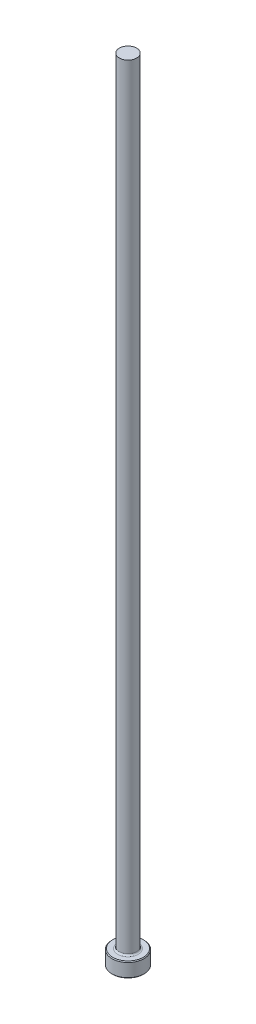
from build123d import *

# Parameters (mm, degrees)
CHAMFER1_SIZE = 0.254
FILLET1_R     = 0.508


with BuildPart() as part:
    # Sketch1 → Revolve1 (revolve)
    with BuildSketch(Plane.XY, mode=Mode.PRIVATE) as revolve1_sk:
        Polygon((0, 0), (-5.1562, 0), (-5.1562, 4.7498), (-2.77749, 4.7498), (-2.77749, 254), (0, 254), align=None)
    revolve(revolve1_sk.sketch.rotate(Axis((0, 259.958771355, 0), (0, -1, 0)), 270), axis=Axis((0, 259.958771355, 0), (0, -1, 0)))

    # Chamfer1
    chamfer1_edges = [part.edges().sort_by_distance(p)[0] for p in [
        (0, 4.7498, -5.1562),
        (0, 0, -5.1562),
    ]]
    chamfer(chamfer1_edges, length=CHAMFER1_SIZE)

    # Fillet1
    fillet1_edges = [part.edges().sort_by_distance(p)[0] for p in [
        (0, 4.7498, -2.77749),
    ]]
    fillet(fillet1_edges, radius=FILLET1_R)


solid = part.part
